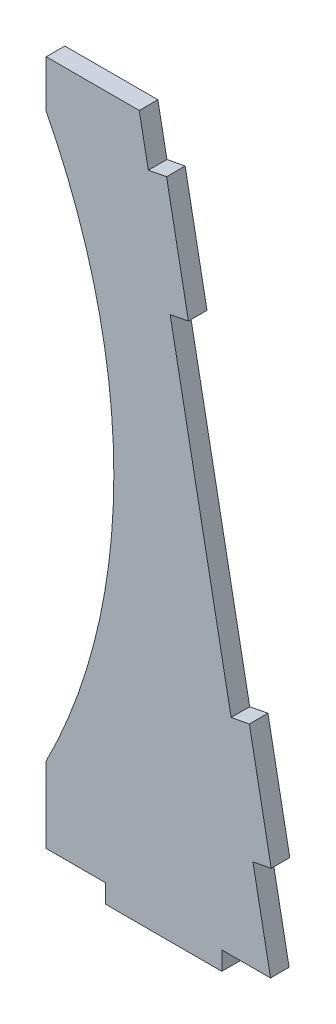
from build123d import *

# Parameters (mm, degrees)
BOSS_EXTRUDE1_DEPTH = 1.524


with BuildPart() as part:
    # Sketch1 → Boss-Extrude1 (new body)
    with BuildSketch(Plane.XY):
        with BuildLine():
            Line((33.443650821, 1.143), (33.443650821, -0.381))
            Line((33.443650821, -0.381), (42.968650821, -0.381))
            Line((42.968650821, -0.381), (42.968650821, 1.143))
            Line((42.968650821, 1.143), (46.962493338, 1.143))
            Line((46.962493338, 1.143), (45.521922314, 8.670574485))
            Line((45.521922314, 8.670574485), (47.018759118, 8.957027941))
            Line((47.018759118, 8.957027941), (45.228425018, 18.312257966))
            Line((45.228425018, 18.312257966), (43.731588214, 18.025804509))
            Line((43.731588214, 18.025804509), (38.735179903, 44.134087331))
            Line((38.735179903, 44.134087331), (40.232016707, 44.420540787))
            Line((40.232016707, 44.420540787), (38.441682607, 53.775770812))
            Line((38.441682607, 53.775770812), (36.944845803, 53.489317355))
            Line((36.944845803, 53.489317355), (36.203903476, 57.361044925))
            Line((36.203903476, 57.361044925), (28.573676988, 57.361044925))
            Line((28.573676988, 57.361044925), (28.573676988, 53.489317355))
            ThreePointArc((28.573676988, 53.489317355), (34.118838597, 30.426503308), (28.573676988, 7.363689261))
            Line((28.573676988, 7.363689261), (28.573676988, 1.143))
            Line((28.573676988, 1.143), (33.443650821, 1.143))
        make_face()
    extrude(amount=BOSS_EXTRUDE1_DEPTH)


solid = part.part
